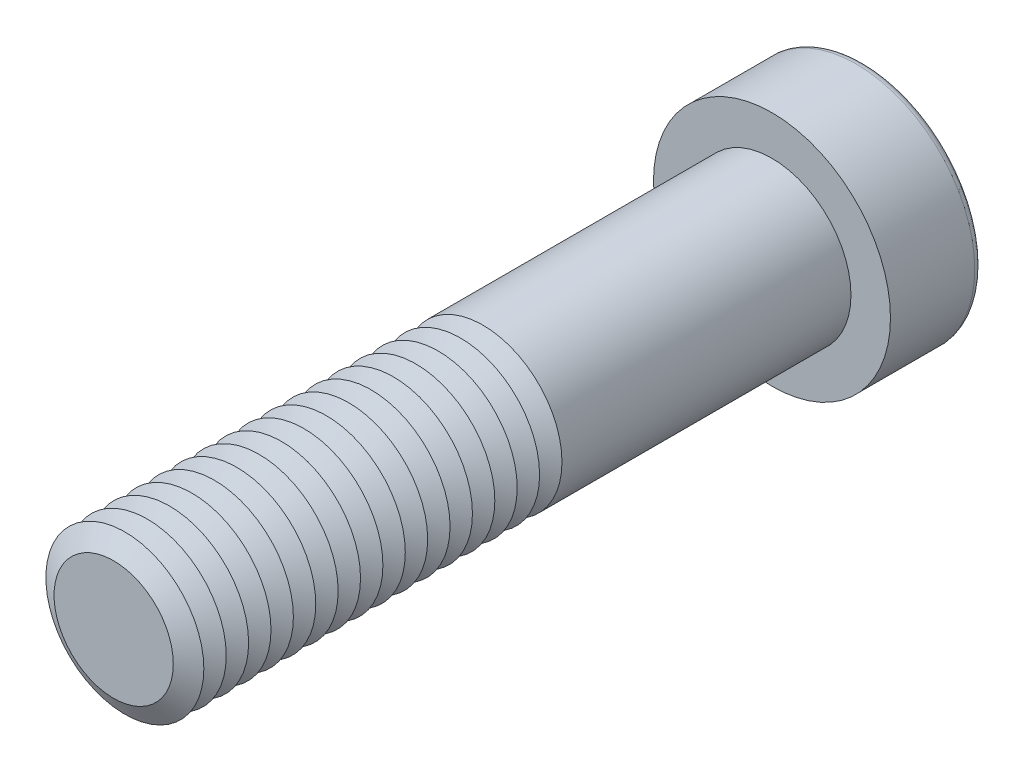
ISO-10303-21;
HEADER;
FILE_DESCRIPTION(('STEP AP214'),'2;1');
FILE_NAME('part.step','',(''),(''),'','','');
FILE_SCHEMA(('AUTOMOTIVE_DESIGN { 1 0 10303 214 1 1 1 1 }'));
ENDSEC;
DATA;
#1=APPLICATION_CONTEXT('core data for automotive mechanical design processes');
#2=APPLICATION_PROTOCOL_DEFINITION('international standard','automotive_design',2000,#1);
#3=PRODUCT_CONTEXT('',#1,'mechanical');
#4=PRODUCT('Part','Part','',(#3));
#5=PRODUCT_RELATED_PRODUCT_CATEGORY('part','',(#4));
#6=PRODUCT_DEFINITION_FORMATION('','',#4);
#7=PRODUCT_DEFINITION_CONTEXT('part definition',#1,'design');
#8=PRODUCT_DEFINITION('design','',#6,#7);
#9=PRODUCT_DEFINITION_SHAPE('','',#8);
#10=(LENGTH_UNIT() NAMED_UNIT(*) SI_UNIT(.MILLI.,.METRE.));
#11=(NAMED_UNIT(*) PLANE_ANGLE_UNIT() SI_UNIT($,.RADIAN.));
#12=(NAMED_UNIT(*) SI_UNIT($,.STERADIAN.) SOLID_ANGLE_UNIT());
#13=UNCERTAINTY_MEASURE_WITH_UNIT(LENGTH_MEASURE(1.E-05),#10,'distance_accuracy_value','');
#14=(GEOMETRIC_REPRESENTATION_CONTEXT(3) GLOBAL_UNCERTAINTY_ASSIGNED_CONTEXT((#13)) GLOBAL_UNIT_ASSIGNED_CONTEXT((#10,
#11,#12)) REPRESENTATION_CONTEXT('',''));
#15=CARTESIAN_POINT('',(0.,0.,0.));
#16=DIRECTION('',(0.,0.,1.));
#17=DIRECTION('',(1.,0.,0.));
#18=AXIS2_PLACEMENT_3D('',#15,#16,#17);
#19=CARTESIAN_POINT('',(0.,0.,44.05));
#20=DIRECTION('',(0.,0.,1.));
#21=DIRECTION('',(1.,0.,0.));
#22=AXIS2_PLACEMENT_3D('',#19,#20,#21);
#23=CONICAL_SURFACE('',#22,6.,1.0471975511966);
#24=CARTESIAN_POINT('',(0.,0.,43.2));
#25=DIRECTION('',(0.,0.,1.));
#26=DIRECTION('',(1.,0.,0.));
#27=AXIS2_PLACEMENT_3D('',#24,#25,#26);
#28=CIRCLE('',#27,4.52775681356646);
#29=CARTESIAN_POINT('',(4.52775681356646,0.,43.2));
#30=VERTEX_POINT('',#29);
#31=EDGE_CURVE('E310',#30,#30,#28,.T.);
#32=ORIENTED_EDGE('',*,*,#31,.T.);
#33=EDGE_LOOP('',(#32));
#34=FACE_BOUND('',#33,.T.);
#35=CARTESIAN_POINT('',(0.,0.,44.05));
#36=DIRECTION('',(0.,0.,1.));
#37=DIRECTION('',(1.,0.,0.));
#38=AXIS2_PLACEMENT_3D('',#35,#36,#37);
#39=CIRCLE('',#38,6.);
#40=CARTESIAN_POINT('',(6.,0.,44.05));
#41=VERTEX_POINT('',#40);
#42=EDGE_CURVE('E313',#41,#41,#39,.T.);
#43=ORIENTED_EDGE('',*,*,#42,.F.);
#44=EDGE_LOOP('',(#43));
#45=FACE_BOUND('',#44,.T.);
#46=ADVANCED_FACE('F39',(#34,#45),#23,.T.);
#47=CARTESIAN_POINT('',(0.,0.,43.2));
#48=DIRECTION('',(0.,0.,-1.));
#49=DIRECTION('',(-1.,0.,0.));
#50=AXIS2_PLACEMENT_3D('',#47,#48,#49);
#51=CONICAL_SURFACE('',#50,4.52775681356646,1.0471975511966);
#52=CARTESIAN_POINT('',(0.,0.,42.35));
#53=DIRECTION('',(0.,0.,1.));
#54=DIRECTION('',(1.,0.,0.));
#55=AXIS2_PLACEMENT_3D('',#52,#53,#54);
#56=CIRCLE('',#55,6.);
#57=CARTESIAN_POINT('',(6.,0.,42.35));
#58=VERTEX_POINT('',#57);
#59=EDGE_CURVE('E321',#58,#58,#56,.T.);
#60=ORIENTED_EDGE('',*,*,#59,.T.);
#61=EDGE_LOOP('',(#60));
#62=FACE_BOUND('',#61,.T.);
#63=ORIENTED_EDGE('',*,*,#31,.F.);
#64=EDGE_LOOP('',(#63));
#65=FACE_BOUND('',#64,.T.);
#66=ADVANCED_FACE('F244',(#62,#65),#51,.T.);
#67=CARTESIAN_POINT('',(0.,0.,50.));
#68=DIRECTION('',(0.,0.,1.));
#69=DIRECTION('',(1.,0.,0.));
#70=AXIS2_PLACEMENT_3D('',#67,#68,#69);
#71=PLANE('',#70);
#72=CARTESIAN_POINT('',(0.,0.,50.));
#73=DIRECTION('',(0.,0.,1.));
#74=DIRECTION('',(1.,0.,0.));
#75=AXIS2_PLACEMENT_3D('',#72,#73,#74);
#76=CIRCLE('',#75,4.52775681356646);
#77=CARTESIAN_POINT('',(4.52775681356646,0.,50.));
#78=VERTEX_POINT('',#77);
#79=EDGE_CURVE('E173',#78,#78,#76,.T.);
#80=ORIENTED_EDGE('',*,*,#79,.T.);
#81=EDGE_LOOP('',(#80));
#82=FACE_BOUND('',#81,.T.);
#83=ADVANCED_FACE('F250',(#82),#71,.T.);
#84=CARTESIAN_POINT('',(0.,0.,50.));
#85=DIRECTION('',(0.,0.,-1.));
#86=DIRECTION('',(-1.,0.,0.));
#87=AXIS2_PLACEMENT_3D('',#84,#85,#86);
#88=CONICAL_SURFACE('',#87,4.52775681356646,1.0471975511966);
#89=CARTESIAN_POINT('',(0.,0.,49.15));
#90=DIRECTION('',(0.,0.,1.));
#91=DIRECTION('',(1.,0.,0.));
#92=AXIS2_PLACEMENT_3D('',#89,#90,#91);
#93=CIRCLE('',#92,6.);
#94=CARTESIAN_POINT('',(6.,0.,49.15));
#95=VERTEX_POINT('',#94);
#96=EDGE_CURVE('E290',#95,#95,#93,.T.);
#97=ORIENTED_EDGE('',*,*,#96,.T.);
#98=EDGE_LOOP('',(#97));
#99=FACE_BOUND('',#98,.T.);
#100=ORIENTED_EDGE('',*,*,#79,.F.);
#101=EDGE_LOOP('',(#100));
#102=FACE_BOUND('',#101,.T.);
#103=ADVANCED_FACE('F198',(#99,#102),#88,.T.);
#104=CARTESIAN_POINT('',(0.,0.,49.15));
#105=DIRECTION('',(0.,0.,1.));
#106=DIRECTION('',(1.,0.,0.));
#107=AXIS2_PLACEMENT_3D('',#104,#105,#106);
#108=CONICAL_SURFACE('',#107,6.,1.0471975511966);
#109=CARTESIAN_POINT('',(0.,0.,48.3));
#110=DIRECTION('',(0.,0.,1.));
#111=DIRECTION('',(1.,0.,0.));
#112=AXIS2_PLACEMENT_3D('',#109,#110,#111);
#113=CIRCLE('',#112,4.52775681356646);
#114=CARTESIAN_POINT('',(4.52775681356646,0.,48.3));
#115=VERTEX_POINT('',#114);
#116=EDGE_CURVE('E287',#115,#115,#113,.T.);
#117=ORIENTED_EDGE('',*,*,#116,.T.);
#118=EDGE_LOOP('',(#117));
#119=FACE_BOUND('',#118,.T.);
#120=ORIENTED_EDGE('',*,*,#96,.F.);
#121=EDGE_LOOP('',(#120));
#122=FACE_BOUND('',#121,.T.);
#123=ADVANCED_FACE('F276',(#119,#122),#108,.T.);
#124=CARTESIAN_POINT('',(0.,0.,48.3));
#125=DIRECTION('',(0.,0.,-1.));
#126=DIRECTION('',(-1.,0.,0.));
#127=AXIS2_PLACEMENT_3D('',#124,#125,#126);
#128=CONICAL_SURFACE('',#127,4.52775681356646,1.0471975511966);
#129=CARTESIAN_POINT('',(0.,0.,47.45));
#130=DIRECTION('',(0.,0.,1.));
#131=DIRECTION('',(1.,0.,0.));
#132=AXIS2_PLACEMENT_3D('',#129,#130,#131);
#133=CIRCLE('',#132,6.);
#134=CARTESIAN_POINT('',(6.,0.,47.45));
#135=VERTEX_POINT('',#134);
#136=EDGE_CURVE('E297',#135,#135,#133,.T.);
#137=ORIENTED_EDGE('',*,*,#136,.T.);
#138=EDGE_LOOP('',(#137));
#139=FACE_BOUND('',#138,.T.);
#140=ORIENTED_EDGE('',*,*,#116,.F.);
#141=EDGE_LOOP('',(#140));
#142=FACE_BOUND('',#141,.T.);
#143=ADVANCED_FACE('F273',(#139,#142),#128,.T.);
#144=CARTESIAN_POINT('',(0.,0.,47.45));
#145=DIRECTION('',(0.,0.,1.));
#146=DIRECTION('',(1.,0.,0.));
#147=AXIS2_PLACEMENT_3D('',#144,#145,#146);
#148=CONICAL_SURFACE('',#147,6.,1.0471975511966);
#149=CARTESIAN_POINT('',(0.,0.,46.6));
#150=DIRECTION('',(0.,0.,1.));
#151=DIRECTION('',(1.,0.,0.));
#152=AXIS2_PLACEMENT_3D('',#149,#150,#151);
#153=CIRCLE('',#152,4.52775681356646);
#154=CARTESIAN_POINT('',(4.52775681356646,0.,46.6));
#155=VERTEX_POINT('',#154);
#156=EDGE_CURVE('E292',#155,#155,#153,.T.);
#157=ORIENTED_EDGE('',*,*,#156,.T.);
#158=EDGE_LOOP('',(#157));
#159=FACE_BOUND('',#158,.T.);
#160=ORIENTED_EDGE('',*,*,#136,.F.);
#161=EDGE_LOOP('',(#160));
#162=FACE_BOUND('',#161,.T.);
#163=ADVANCED_FACE('F269',(#159,#162),#148,.T.);
#164=CARTESIAN_POINT('',(0.,0.,46.6));
#165=DIRECTION('',(0.,0.,-1.));
#166=DIRECTION('',(-1.,0.,0.));
#167=AXIS2_PLACEMENT_3D('',#164,#165,#166);
#168=CONICAL_SURFACE('',#167,4.52775681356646,1.0471975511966);
#169=CARTESIAN_POINT('',(0.,0.,45.75));
#170=DIRECTION('',(0.,0.,1.));
#171=DIRECTION('',(1.,0.,0.));
#172=AXIS2_PLACEMENT_3D('',#169,#170,#171);
#173=CIRCLE('',#172,6.);
#174=CARTESIAN_POINT('',(6.,0.,45.75));
#175=VERTEX_POINT('',#174);
#176=EDGE_CURVE('E306',#175,#175,#173,.T.);
#177=ORIENTED_EDGE('',*,*,#176,.T.);
#178=EDGE_LOOP('',(#177));
#179=FACE_BOUND('',#178,.T.);
#180=ORIENTED_EDGE('',*,*,#156,.F.);
#181=EDGE_LOOP('',(#180));
#182=FACE_BOUND('',#181,.T.);
#183=ADVANCED_FACE('F265',(#179,#182),#168,.T.);
#184=CARTESIAN_POINT('',(0.,0.,45.75));
#185=DIRECTION('',(0.,0.,1.));
#186=DIRECTION('',(1.,0.,0.));
#187=AXIS2_PLACEMENT_3D('',#184,#185,#186);
#188=CONICAL_SURFACE('',#187,6.,1.0471975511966);
#189=CARTESIAN_POINT('',(0.,0.,44.9));
#190=DIRECTION('',(0.,0.,1.));
#191=DIRECTION('',(1.,0.,0.));
#192=AXIS2_PLACEMENT_3D('',#189,#190,#191);
#193=CIRCLE('',#192,4.52775681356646);
#194=CARTESIAN_POINT('',(4.52775681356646,0.,44.9));
#195=VERTEX_POINT('',#194);
#196=EDGE_CURVE('E302',#195,#195,#193,.T.);
#197=ORIENTED_EDGE('',*,*,#196,.T.);
#198=EDGE_LOOP('',(#197));
#199=FACE_BOUND('',#198,.T.);
#200=ORIENTED_EDGE('',*,*,#176,.F.);
#201=EDGE_LOOP('',(#200));
#202=FACE_BOUND('',#201,.T.);
#203=ADVANCED_FACE('F261',(#199,#202),#188,.T.);
#204=CARTESIAN_POINT('',(0.,0.,44.9));
#205=DIRECTION('',(0.,0.,-1.));
#206=DIRECTION('',(-1.,0.,0.));
#207=AXIS2_PLACEMENT_3D('',#204,#205,#206);
#208=CONICAL_SURFACE('',#207,4.52775681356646,1.0471975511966);
#209=ORIENTED_EDGE('',*,*,#42,.T.);
#210=EDGE_LOOP('',(#209));
#211=FACE_BOUND('',#210,.T.);
#212=ORIENTED_EDGE('',*,*,#196,.F.);
#213=EDGE_LOOP('',(#212));
#214=FACE_BOUND('',#213,.T.);
#215=ADVANCED_FACE('F257',(#211,#214),#208,.T.);
#216=CARTESIAN_POINT('',(0.,0.,42.35));
#217=DIRECTION('',(0.,0.,1.));
#218=DIRECTION('',(1.,0.,0.));
#219=AXIS2_PLACEMENT_3D('',#216,#217,#218);
#220=CONICAL_SURFACE('',#219,6.,1.0471975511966);
#221=CARTESIAN_POINT('',(0.,0.,41.5));
#222=DIRECTION('',(0.,0.,1.));
#223=DIRECTION('',(1.,0.,0.));
#224=AXIS2_PLACEMENT_3D('',#221,#222,#223);
#225=CIRCLE('',#224,4.52775681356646);
#226=CARTESIAN_POINT('',(4.52775681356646,0.,41.5));
#227=VERTEX_POINT('',#226);
#228=EDGE_CURVE('E317',#227,#227,#225,.T.);
#229=ORIENTED_EDGE('',*,*,#228,.T.);
#230=EDGE_LOOP('',(#229));
#231=FACE_BOUND('',#230,.T.);
#232=ORIENTED_EDGE('',*,*,#59,.F.);
#233=EDGE_LOOP('',(#232));
#234=FACE_BOUND('',#233,.T.);
#235=ADVANCED_FACE('F260',(#231,#234),#220,.T.);
#236=CARTESIAN_POINT('',(0.,0.,41.5));
#237=DIRECTION('',(0.,0.,-1.));
#238=DIRECTION('',(-1.,0.,0.));
#239=AXIS2_PLACEMENT_3D('',#236,#237,#238);
#240=CONICAL_SURFACE('',#239,4.52775681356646,1.0471975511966);
#241=CARTESIAN_POINT('',(0.,0.,40.65));
#242=DIRECTION('',(0.,0.,1.));
#243=DIRECTION('',(1.,0.,0.));
#244=AXIS2_PLACEMENT_3D('',#241,#242,#243);
#245=CIRCLE('',#244,6.);
#246=CARTESIAN_POINT('',(6.,0.,40.65));
#247=VERTEX_POINT('',#246);
#248=EDGE_CURVE('E329',#247,#247,#245,.T.);
#249=ORIENTED_EDGE('',*,*,#248,.T.);
#250=EDGE_LOOP('',(#249));
#251=FACE_BOUND('',#250,.T.);
#252=ORIENTED_EDGE('',*,*,#228,.F.);
#253=EDGE_LOOP('',(#252));
#254=FACE_BOUND('',#253,.T.);
#255=ADVANCED_FACE('F510',(#251,#254),#240,.T.);
#256=CARTESIAN_POINT('',(0.,0.,40.65));
#257=DIRECTION('',(0.,0.,1.));
#258=DIRECTION('',(1.,0.,0.));
#259=AXIS2_PLACEMENT_3D('',#256,#257,#258);
#260=CONICAL_SURFACE('',#259,6.,1.0471975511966);
#261=CARTESIAN_POINT('',(0.,0.,39.8));
#262=DIRECTION('',(0.,0.,1.));
#263=DIRECTION('',(1.,0.,0.));
#264=AXIS2_PLACEMENT_3D('',#261,#262,#263);
#265=CIRCLE('',#264,4.52775681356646);
#266=CARTESIAN_POINT('',(4.52775681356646,0.,39.8));
#267=VERTEX_POINT('',#266);
#268=EDGE_CURVE('E325',#267,#267,#265,.T.);
#269=ORIENTED_EDGE('',*,*,#268,.T.);
#270=EDGE_LOOP('',(#269));
#271=FACE_BOUND('',#270,.T.);
#272=ORIENTED_EDGE('',*,*,#248,.F.);
#273=EDGE_LOOP('',(#272));
#274=FACE_BOUND('',#273,.T.);
#275=ADVANCED_FACE('F506',(#271,#274),#260,.T.);
#276=CARTESIAN_POINT('',(0.,0.,39.8));
#277=DIRECTION('',(0.,0.,-1.));
#278=DIRECTION('',(-1.,0.,0.));
#279=AXIS2_PLACEMENT_3D('',#276,#277,#278);
#280=CONICAL_SURFACE('',#279,4.52775681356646,1.0471975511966);
#281=CARTESIAN_POINT('',(0.,0.,38.95));
#282=DIRECTION('',(0.,0.,1.));
#283=DIRECTION('',(1.,0.,0.));
#284=AXIS2_PLACEMENT_3D('',#281,#282,#283);
#285=CIRCLE('',#284,6.);
#286=CARTESIAN_POINT('',(6.,0.,38.95));
#287=VERTEX_POINT('',#286);
#288=EDGE_CURVE('E337',#287,#287,#285,.T.);
#289=ORIENTED_EDGE('',*,*,#288,.T.);
#290=EDGE_LOOP('',(#289));
#291=FACE_BOUND('',#290,.T.);
#292=ORIENTED_EDGE('',*,*,#268,.F.);
#293=EDGE_LOOP('',(#292));
#294=FACE_BOUND('',#293,.T.);
#295=ADVANCED_FACE('F502',(#291,#294),#280,.T.);
#296=CARTESIAN_POINT('',(0.,0.,38.95));
#297=DIRECTION('',(0.,0.,1.));
#298=DIRECTION('',(1.,0.,0.));
#299=AXIS2_PLACEMENT_3D('',#296,#297,#298);
#300=CONICAL_SURFACE('',#299,6.,1.0471975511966);
#301=CARTESIAN_POINT('',(0.,0.,38.1));
#302=DIRECTION('',(0.,0.,1.));
#303=DIRECTION('',(1.,0.,0.));
#304=AXIS2_PLACEMENT_3D('',#301,#302,#303);
#305=CIRCLE('',#304,4.52775681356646);
#306=CARTESIAN_POINT('',(4.52775681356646,0.,38.1));
#307=VERTEX_POINT('',#306);
#308=EDGE_CURVE('E333',#307,#307,#305,.T.);
#309=ORIENTED_EDGE('',*,*,#308,.T.);
#310=EDGE_LOOP('',(#309));
#311=FACE_BOUND('',#310,.T.);
#312=ORIENTED_EDGE('',*,*,#288,.F.);
#313=EDGE_LOOP('',(#312));
#314=FACE_BOUND('',#313,.T.);
#315=ADVANCED_FACE('F498',(#311,#314),#300,.T.);
#316=CARTESIAN_POINT('',(0.,0.,38.1));
#317=DIRECTION('',(0.,0.,-1.));
#318=DIRECTION('',(-1.,0.,0.));
#319=AXIS2_PLACEMENT_3D('',#316,#317,#318);
#320=CONICAL_SURFACE('',#319,4.52775681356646,1.0471975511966);
#321=CARTESIAN_POINT('',(0.,0.,37.25));
#322=DIRECTION('',(0.,0.,1.));
#323=DIRECTION('',(1.,0.,0.));
#324=AXIS2_PLACEMENT_3D('',#321,#322,#323);
#325=CIRCLE('',#324,6.);
#326=CARTESIAN_POINT('',(6.,0.,37.25));
#327=VERTEX_POINT('',#326);
#328=EDGE_CURVE('E345',#327,#327,#325,.T.);
#329=ORIENTED_EDGE('',*,*,#328,.T.);
#330=EDGE_LOOP('',(#329));
#331=FACE_BOUND('',#330,.T.);
#332=ORIENTED_EDGE('',*,*,#308,.F.);
#333=EDGE_LOOP('',(#332));
#334=FACE_BOUND('',#333,.T.);
#335=ADVANCED_FACE('F494',(#331,#334),#320,.T.);
#336=CARTESIAN_POINT('',(0.,0.,37.25));
#337=DIRECTION('',(0.,0.,1.));
#338=DIRECTION('',(1.,0.,0.));
#339=AXIS2_PLACEMENT_3D('',#336,#337,#338);
#340=CONICAL_SURFACE('',#339,6.,1.0471975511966);
#341=CARTESIAN_POINT('',(0.,0.,36.4));
#342=DIRECTION('',(0.,0.,1.));
#343=DIRECTION('',(1.,0.,0.));
#344=AXIS2_PLACEMENT_3D('',#341,#342,#343);
#345=CIRCLE('',#344,4.52775681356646);
#346=CARTESIAN_POINT('',(4.52775681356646,0.,36.4));
#347=VERTEX_POINT('',#346);
#348=EDGE_CURVE('E341',#347,#347,#345,.T.);
#349=ORIENTED_EDGE('',*,*,#348,.T.);
#350=EDGE_LOOP('',(#349));
#351=FACE_BOUND('',#350,.T.);
#352=ORIENTED_EDGE('',*,*,#328,.F.);
#353=EDGE_LOOP('',(#352));
#354=FACE_BOUND('',#353,.T.);
#355=ADVANCED_FACE('F490',(#351,#354),#340,.T.);
#356=CARTESIAN_POINT('',(0.,0.,36.4));
#357=DIRECTION('',(0.,0.,-1.));
#358=DIRECTION('',(-1.,0.,0.));
#359=AXIS2_PLACEMENT_3D('',#356,#357,#358);
#360=CONICAL_SURFACE('',#359,4.52775681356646,1.0471975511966);
#361=CARTESIAN_POINT('',(0.,0.,35.55));
#362=DIRECTION('',(0.,0.,1.));
#363=DIRECTION('',(1.,0.,0.));
#364=AXIS2_PLACEMENT_3D('',#361,#362,#363);
#365=CIRCLE('',#364,6.);
#366=CARTESIAN_POINT('',(6.,0.,35.55));
#367=VERTEX_POINT('',#366);
#368=EDGE_CURVE('E353',#367,#367,#365,.T.);
#369=ORIENTED_EDGE('',*,*,#368,.T.);
#370=EDGE_LOOP('',(#369));
#371=FACE_BOUND('',#370,.T.);
#372=ORIENTED_EDGE('',*,*,#348,.F.);
#373=EDGE_LOOP('',(#372));
#374=FACE_BOUND('',#373,.T.);
#375=ADVANCED_FACE('F486',(#371,#374),#360,.T.);
#376=CARTESIAN_POINT('',(0.,0.,35.55));
#377=DIRECTION('',(0.,0.,1.));
#378=DIRECTION('',(1.,0.,0.));
#379=AXIS2_PLACEMENT_3D('',#376,#377,#378);
#380=CONICAL_SURFACE('',#379,6.,1.0471975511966);
#381=CARTESIAN_POINT('',(0.,0.,34.7));
#382=DIRECTION('',(0.,0.,1.));
#383=DIRECTION('',(1.,0.,0.));
#384=AXIS2_PLACEMENT_3D('',#381,#382,#383);
#385=CIRCLE('',#384,4.52775681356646);
#386=CARTESIAN_POINT('',(4.52775681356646,0.,34.7));
#387=VERTEX_POINT('',#386);
#388=EDGE_CURVE('E349',#387,#387,#385,.T.);
#389=ORIENTED_EDGE('',*,*,#388,.T.);
#390=EDGE_LOOP('',(#389));
#391=FACE_BOUND('',#390,.T.);
#392=ORIENTED_EDGE('',*,*,#368,.F.);
#393=EDGE_LOOP('',(#392));
#394=FACE_BOUND('',#393,.T.);
#395=ADVANCED_FACE('F482',(#391,#394),#380,.T.);
#396=CARTESIAN_POINT('',(0.,0.,34.7));
#397=DIRECTION('',(0.,0.,-1.));
#398=DIRECTION('',(-1.,0.,0.));
#399=AXIS2_PLACEMENT_3D('',#396,#397,#398);
#400=CONICAL_SURFACE('',#399,4.52775681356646,1.0471975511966);
#401=CARTESIAN_POINT('',(0.,0.,33.85));
#402=DIRECTION('',(0.,0.,1.));
#403=DIRECTION('',(1.,0.,0.));
#404=AXIS2_PLACEMENT_3D('',#401,#402,#403);
#405=CIRCLE('',#404,6.);
#406=CARTESIAN_POINT('',(6.,0.,33.85));
#407=VERTEX_POINT('',#406);
#408=EDGE_CURVE('E361',#407,#407,#405,.T.);
#409=ORIENTED_EDGE('',*,*,#408,.T.);
#410=EDGE_LOOP('',(#409));
#411=FACE_BOUND('',#410,.T.);
#412=ORIENTED_EDGE('',*,*,#388,.F.);
#413=EDGE_LOOP('',(#412));
#414=FACE_BOUND('',#413,.T.);
#415=ADVANCED_FACE('F478',(#411,#414),#400,.T.);
#416=CARTESIAN_POINT('',(0.,0.,33.85));
#417=DIRECTION('',(0.,0.,1.));
#418=DIRECTION('',(1.,0.,0.));
#419=AXIS2_PLACEMENT_3D('',#416,#417,#418);
#420=CONICAL_SURFACE('',#419,6.,1.0471975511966);
#421=CARTESIAN_POINT('',(0.,0.,33.));
#422=DIRECTION('',(0.,0.,1.));
#423=DIRECTION('',(1.,0.,0.));
#424=AXIS2_PLACEMENT_3D('',#421,#422,#423);
#425=CIRCLE('',#424,4.52775681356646);
#426=CARTESIAN_POINT('',(4.52775681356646,0.,33.));
#427=VERTEX_POINT('',#426);
#428=EDGE_CURVE('E357',#427,#427,#425,.T.);
#429=ORIENTED_EDGE('',*,*,#428,.T.);
#430=EDGE_LOOP('',(#429));
#431=FACE_BOUND('',#430,.T.);
#432=ORIENTED_EDGE('',*,*,#408,.F.);
#433=EDGE_LOOP('',(#432));
#434=FACE_BOUND('',#433,.T.);
#435=ADVANCED_FACE('F474',(#431,#434),#420,.T.);
#436=CARTESIAN_POINT('',(0.,0.,33.));
#437=DIRECTION('',(0.,0.,-1.));
#438=DIRECTION('',(-1.,0.,0.));
#439=AXIS2_PLACEMENT_3D('',#436,#437,#438);
#440=CONICAL_SURFACE('',#439,4.52775681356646,1.0471975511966);
#441=CARTESIAN_POINT('',(0.,0.,32.15));
#442=DIRECTION('',(0.,0.,1.));
#443=DIRECTION('',(1.,0.,0.));
#444=AXIS2_PLACEMENT_3D('',#441,#442,#443);
#445=CIRCLE('',#444,6.);
#446=CARTESIAN_POINT('',(6.,0.,32.15));
#447=VERTEX_POINT('',#446);
#448=EDGE_CURVE('E369',#447,#447,#445,.T.);
#449=ORIENTED_EDGE('',*,*,#448,.T.);
#450=EDGE_LOOP('',(#449));
#451=FACE_BOUND('',#450,.T.);
#452=ORIENTED_EDGE('',*,*,#428,.F.);
#453=EDGE_LOOP('',(#452));
#454=FACE_BOUND('',#453,.T.);
#455=ADVANCED_FACE('F470',(#451,#454),#440,.T.);
#456=CARTESIAN_POINT('',(0.,0.,32.15));
#457=DIRECTION('',(0.,0.,1.));
#458=DIRECTION('',(1.,0.,0.));
#459=AXIS2_PLACEMENT_3D('',#456,#457,#458);
#460=CONICAL_SURFACE('',#459,6.,1.0471975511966);
#461=CARTESIAN_POINT('',(0.,0.,31.3));
#462=DIRECTION('',(0.,0.,1.));
#463=DIRECTION('',(1.,0.,0.));
#464=AXIS2_PLACEMENT_3D('',#461,#462,#463);
#465=CIRCLE('',#464,4.52775681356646);
#466=CARTESIAN_POINT('',(4.52775681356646,0.,31.3));
#467=VERTEX_POINT('',#466);
#468=EDGE_CURVE('E365',#467,#467,#465,.T.);
#469=ORIENTED_EDGE('',*,*,#468,.T.);
#470=EDGE_LOOP('',(#469));
#471=FACE_BOUND('',#470,.T.);
#472=ORIENTED_EDGE('',*,*,#448,.F.);
#473=EDGE_LOOP('',(#472));
#474=FACE_BOUND('',#473,.T.);
#475=ADVANCED_FACE('F466',(#471,#474),#460,.T.);
#476=CARTESIAN_POINT('',(0.,0.,31.3));
#477=DIRECTION('',(0.,0.,-1.));
#478=DIRECTION('',(-1.,0.,0.));
#479=AXIS2_PLACEMENT_3D('',#476,#477,#478);
#480=CONICAL_SURFACE('',#479,4.52775681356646,1.0471975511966);
#481=CARTESIAN_POINT('',(0.,0.,30.45));
#482=DIRECTION('',(0.,0.,1.));
#483=DIRECTION('',(1.,0.,0.));
#484=AXIS2_PLACEMENT_3D('',#481,#482,#483);
#485=CIRCLE('',#484,6.);
#486=CARTESIAN_POINT('',(6.,0.,30.45));
#487=VERTEX_POINT('',#486);
#488=EDGE_CURVE('E377',#487,#487,#485,.T.);
#489=ORIENTED_EDGE('',*,*,#488,.T.);
#490=EDGE_LOOP('',(#489));
#491=FACE_BOUND('',#490,.T.);
#492=ORIENTED_EDGE('',*,*,#468,.F.);
#493=EDGE_LOOP('',(#492));
#494=FACE_BOUND('',#493,.T.);
#495=ADVANCED_FACE('F462',(#491,#494),#480,.T.);
#496=CARTESIAN_POINT('',(0.,0.,30.45));
#497=DIRECTION('',(0.,0.,1.));
#498=DIRECTION('',(1.,0.,0.));
#499=AXIS2_PLACEMENT_3D('',#496,#497,#498);
#500=CONICAL_SURFACE('',#499,6.,1.0471975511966);
#501=CARTESIAN_POINT('',(0.,0.,29.6));
#502=DIRECTION('',(0.,0.,1.));
#503=DIRECTION('',(1.,0.,0.));
#504=AXIS2_PLACEMENT_3D('',#501,#502,#503);
#505=CIRCLE('',#504,4.52775681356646);
#506=CARTESIAN_POINT('',(4.52775681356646,0.,29.6));
#507=VERTEX_POINT('',#506);
#508=EDGE_CURVE('E373',#507,#507,#505,.T.);
#509=ORIENTED_EDGE('',*,*,#508,.T.);
#510=EDGE_LOOP('',(#509));
#511=FACE_BOUND('',#510,.T.);
#512=ORIENTED_EDGE('',*,*,#488,.F.);
#513=EDGE_LOOP('',(#512));
#514=FACE_BOUND('',#513,.T.);
#515=ADVANCED_FACE('F458',(#511,#514),#500,.T.);
#516=CARTESIAN_POINT('',(0.,0.,29.6));
#517=DIRECTION('',(0.,0.,-1.));
#518=DIRECTION('',(-1.,0.,0.));
#519=AXIS2_PLACEMENT_3D('',#516,#517,#518);
#520=CONICAL_SURFACE('',#519,4.52775681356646,1.0471975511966);
#521=CARTESIAN_POINT('',(0.,0.,28.75));
#522=DIRECTION('',(0.,0.,1.));
#523=DIRECTION('',(1.,0.,0.));
#524=AXIS2_PLACEMENT_3D('',#521,#522,#523);
#525=CIRCLE('',#524,6.);
#526=CARTESIAN_POINT('',(6.,0.,28.75));
#527=VERTEX_POINT('',#526);
#528=EDGE_CURVE('E385',#527,#527,#525,.T.);
#529=ORIENTED_EDGE('',*,*,#528,.T.);
#530=EDGE_LOOP('',(#529));
#531=FACE_BOUND('',#530,.T.);
#532=ORIENTED_EDGE('',*,*,#508,.F.);
#533=EDGE_LOOP('',(#532));
#534=FACE_BOUND('',#533,.T.);
#535=ADVANCED_FACE('F454',(#531,#534),#520,.T.);
#536=CARTESIAN_POINT('',(0.,0.,28.75));
#537=DIRECTION('',(0.,0.,1.));
#538=DIRECTION('',(1.,0.,0.));
#539=AXIS2_PLACEMENT_3D('',#536,#537,#538);
#540=CONICAL_SURFACE('',#539,6.,1.0471975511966);
#541=CARTESIAN_POINT('',(0.,0.,27.9));
#542=DIRECTION('',(0.,0.,1.));
#543=DIRECTION('',(1.,0.,0.));
#544=AXIS2_PLACEMENT_3D('',#541,#542,#543);
#545=CIRCLE('',#544,4.52775681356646);
#546=CARTESIAN_POINT('',(4.52775681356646,0.,27.9));
#547=VERTEX_POINT('',#546);
#548=EDGE_CURVE('E381',#547,#547,#545,.T.);
#549=ORIENTED_EDGE('',*,*,#548,.T.);
#550=EDGE_LOOP('',(#549));
#551=FACE_BOUND('',#550,.T.);
#552=ORIENTED_EDGE('',*,*,#528,.F.);
#553=EDGE_LOOP('',(#552));
#554=FACE_BOUND('',#553,.T.);
#555=ADVANCED_FACE('F450',(#551,#554),#540,.T.);
#556=CARTESIAN_POINT('',(0.,0.,27.9));
#557=DIRECTION('',(0.,0.,-1.));
#558=DIRECTION('',(-1.,0.,0.));
#559=AXIS2_PLACEMENT_3D('',#556,#557,#558);
#560=CONICAL_SURFACE('',#559,4.52775681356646,1.0471975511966);
#561=CARTESIAN_POINT('',(0.,0.,27.05));
#562=DIRECTION('',(0.,0.,1.));
#563=DIRECTION('',(1.,0.,0.));
#564=AXIS2_PLACEMENT_3D('',#561,#562,#563);
#565=CIRCLE('',#564,6.);
#566=CARTESIAN_POINT('',(6.,0.,27.05));
#567=VERTEX_POINT('',#566);
#568=EDGE_CURVE('E393',#567,#567,#565,.T.);
#569=ORIENTED_EDGE('',*,*,#568,.T.);
#570=EDGE_LOOP('',(#569));
#571=FACE_BOUND('',#570,.T.);
#572=ORIENTED_EDGE('',*,*,#548,.F.);
#573=EDGE_LOOP('',(#572));
#574=FACE_BOUND('',#573,.T.);
#575=ADVANCED_FACE('F446',(#571,#574),#560,.T.);
#576=CARTESIAN_POINT('',(0.,0.,27.05));
#577=DIRECTION('',(0.,0.,1.));
#578=DIRECTION('',(1.,0.,0.));
#579=AXIS2_PLACEMENT_3D('',#576,#577,#578);
#580=CONICAL_SURFACE('',#579,6.,1.0471975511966);
#581=CARTESIAN_POINT('',(0.,0.,26.2));
#582=DIRECTION('',(0.,0.,1.));
#583=DIRECTION('',(1.,0.,0.));
#584=AXIS2_PLACEMENT_3D('',#581,#582,#583);
#585=CIRCLE('',#584,4.52775681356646);
#586=CARTESIAN_POINT('',(4.52775681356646,0.,26.2));
#587=VERTEX_POINT('',#586);
#588=EDGE_CURVE('E389',#587,#587,#585,.T.);
#589=ORIENTED_EDGE('',*,*,#588,.T.);
#590=EDGE_LOOP('',(#589));
#591=FACE_BOUND('',#590,.T.);
#592=ORIENTED_EDGE('',*,*,#568,.F.);
#593=EDGE_LOOP('',(#592));
#594=FACE_BOUND('',#593,.T.);
#595=ADVANCED_FACE('F442',(#591,#594),#580,.T.);
#596=CARTESIAN_POINT('',(0.,0.,26.2));
#597=DIRECTION('',(0.,0.,-1.));
#598=DIRECTION('',(-1.,0.,0.));
#599=AXIS2_PLACEMENT_3D('',#596,#597,#598);
#600=CONICAL_SURFACE('',#599,4.52775681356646,1.0471975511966);
#601=CARTESIAN_POINT('',(0.,0.,25.35));
#602=DIRECTION('',(0.,0.,1.));
#603=DIRECTION('',(1.,0.,0.));
#604=AXIS2_PLACEMENT_3D('',#601,#602,#603);
#605=CIRCLE('',#604,6.);
#606=CARTESIAN_POINT('',(6.,0.,25.35));
#607=VERTEX_POINT('',#606);
#608=EDGE_CURVE('E401',#607,#607,#605,.T.);
#609=ORIENTED_EDGE('',*,*,#608,.T.);
#610=EDGE_LOOP('',(#609));
#611=FACE_BOUND('',#610,.T.);
#612=ORIENTED_EDGE('',*,*,#588,.F.);
#613=EDGE_LOOP('',(#612));
#614=FACE_BOUND('',#613,.T.);
#615=ADVANCED_FACE('F438',(#611,#614),#600,.T.);
#616=CARTESIAN_POINT('',(0.,0.,25.35));
#617=DIRECTION('',(0.,0.,1.));
#618=DIRECTION('',(1.,0.,0.));
#619=AXIS2_PLACEMENT_3D('',#616,#617,#618);
#620=CONICAL_SURFACE('',#619,6.,1.0471975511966);
#621=CARTESIAN_POINT('',(0.,0.,24.5));
#622=DIRECTION('',(0.,0.,1.));
#623=DIRECTION('',(1.,0.,0.));
#624=AXIS2_PLACEMENT_3D('',#621,#622,#623);
#625=CIRCLE('',#624,4.52775681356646);
#626=CARTESIAN_POINT('',(4.52775681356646,0.,24.5));
#627=VERTEX_POINT('',#626);
#628=EDGE_CURVE('E397',#627,#627,#625,.T.);
#629=ORIENTED_EDGE('',*,*,#628,.T.);
#630=EDGE_LOOP('',(#629));
#631=FACE_BOUND('',#630,.T.);
#632=ORIENTED_EDGE('',*,*,#608,.F.);
#633=EDGE_LOOP('',(#632));
#634=FACE_BOUND('',#633,.T.);
#635=ADVANCED_FACE('F433',(#631,#634),#620,.T.);
#636=CARTESIAN_POINT('',(0.,0.,24.5));
#637=DIRECTION('',(0.,0.,-1.));
#638=DIRECTION('',(-1.,0.,0.));
#639=AXIS2_PLACEMENT_3D('',#636,#637,#638);
#640=CONICAL_SURFACE('',#639,4.52775681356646,1.0471975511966);
#641=CARTESIAN_POINT('',(0.,0.,23.65));
#642=DIRECTION('',(0.,0.,1.));
#643=DIRECTION('',(1.,0.,0.));
#644=AXIS2_PLACEMENT_3D('',#641,#642,#643);
#645=CIRCLE('',#644,6.);
#646=CARTESIAN_POINT('',(6.,0.,23.65));
#647=VERTEX_POINT('',#646);
#648=EDGE_CURVE('E413',#647,#647,#645,.T.);
#649=ORIENTED_EDGE('',*,*,#648,.T.);
#650=EDGE_LOOP('',(#649));
#651=FACE_BOUND('',#650,.T.);
#652=ORIENTED_EDGE('',*,*,#628,.F.);
#653=EDGE_LOOP('',(#652));
#654=FACE_BOUND('',#653,.T.);
#655=ADVANCED_FACE('F419',(#651,#654),#640,.T.);
#656=CARTESIAN_POINT('',(0.,0.,23.65));
#657=DIRECTION('',(0.,0.,1.));
#658=DIRECTION('',(1.,0.,0.));
#659=AXIS2_PLACEMENT_3D('',#656,#657,#658);
#660=CONICAL_SURFACE('',#659,6.,1.0471975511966);
#661=CARTESIAN_POINT('',(0.,0.,22.8));
#662=DIRECTION('',(0.,0.,1.));
#663=DIRECTION('',(1.,0.,0.));
#664=AXIS2_PLACEMENT_3D('',#661,#662,#663);
#665=CIRCLE('',#664,4.52775681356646);
#666=CARTESIAN_POINT('',(4.52775681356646,0.,22.8));
#667=VERTEX_POINT('',#666);
#668=EDGE_CURVE('E405',#667,#667,#665,.T.);
#669=ORIENTED_EDGE('',*,*,#668,.T.);
#670=EDGE_LOOP('',(#669));
#671=FACE_BOUND('',#670,.T.);
#672=ORIENTED_EDGE('',*,*,#648,.F.);
#673=EDGE_LOOP('',(#672));
#674=FACE_BOUND('',#673,.T.);
#675=ADVANCED_FACE('F422',(#671,#674),#660,.T.);
#676=CARTESIAN_POINT('',(0.,0.,22.8));
#677=DIRECTION('',(0.,0.,-1.));
#678=DIRECTION('',(-1.,0.,0.));
#679=AXIS2_PLACEMENT_3D('',#676,#677,#678);
#680=CONICAL_SURFACE('',#679,4.52775681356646,1.0471975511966);
#681=CARTESIAN_POINT('',(0.,0.,21.95));
#682=DIRECTION('',(0.,0.,1.));
#683=DIRECTION('',(1.,0.,0.));
#684=AXIS2_PLACEMENT_3D('',#681,#682,#683);
#685=CIRCLE('',#684,6.);
#686=CARTESIAN_POINT('',(6.,0.,21.95));
#687=VERTEX_POINT('',#686);
#688=EDGE_CURVE('E409',#687,#687,#685,.T.);
#689=ORIENTED_EDGE('',*,*,#688,.T.);
#690=EDGE_LOOP('',(#689));
#691=FACE_BOUND('',#690,.T.);
#692=ORIENTED_EDGE('',*,*,#668,.F.);
#693=EDGE_LOOP('',(#692));
#694=FACE_BOUND('',#693,.T.);
#695=ADVANCED_FACE('F424',(#691,#694),#680,.T.);
#696=CARTESIAN_POINT('',(0.,0.,-1.));
#697=DIRECTION('',(0.,0.,-1.));
#698=DIRECTION('',(-1.,0.,0.));
#699=AXIS2_PLACEMENT_3D('',#696,#697,#698);
#700=CONICAL_SURFACE('',#699,4.,1.0471975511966);
#701=CARTESIAN_POINT('',(0.,0.,1.30940107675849));
#702=VERTEX_POINT('',#701);
#703=VERTEX_LOOP('',#702);
#704=FACE_BOUND('',#703,.T.);
#705=CARTESIAN_POINT('',(0.,0.,-1.));
#706=DIRECTION('',(0.,0.,-1.));
#707=DIRECTION('',(-1.,0.,0.));
#708=AXIS2_PLACEMENT_3D('',#705,#706,#707);
#709=CIRCLE('',#708,4.);
#710=CARTESIAN_POINT('',(-3.46410161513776,2.,-1.));
#711=VERTEX_POINT('',#710);
#712=CARTESIAN_POINT('',(0.,4.,-1.));
#713=VERTEX_POINT('',#712);
#714=EDGE_CURVE('E149',#711,#713,#709,.T.);
#715=ORIENTED_EDGE('',*,*,#714,.T.);
#716=CARTESIAN_POINT('',(0.,0.,-1.));
#717=DIRECTION('',(0.,0.,-1.));
#718=DIRECTION('',(-1.,0.,0.));
#719=AXIS2_PLACEMENT_3D('',#716,#717,#718);
#720=CIRCLE('',#719,4.);
#721=CARTESIAN_POINT('',(3.46410161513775,2.,-1.));
#722=VERTEX_POINT('',#721);
#723=EDGE_CURVE('E54',#713,#722,#720,.T.);
#724=ORIENTED_EDGE('',*,*,#723,.T.);
#725=CARTESIAN_POINT('',(3.46410161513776,-2.,-1.));
#726=VERTEX_POINT('',#725);
#727=EDGE_CURVE('E1028',#722,#726,#720,.T.);
#728=ORIENTED_EDGE('',*,*,#727,.T.);
#729=CARTESIAN_POINT('',(0.,-4.,-1.));
#730=VERTEX_POINT('',#729);
#731=EDGE_CURVE('E1026',#726,#730,#720,.T.);
#732=ORIENTED_EDGE('',*,*,#731,.T.);
#733=CARTESIAN_POINT('',(-3.46410161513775,-2.,-1.));
#734=VERTEX_POINT('',#733);
#735=EDGE_CURVE('E1021',#730,#734,#720,.T.);
#736=ORIENTED_EDGE('',*,*,#735,.T.);
#737=EDGE_CURVE('E1019',#734,#711,#720,.T.);
#738=ORIENTED_EDGE('',*,*,#737,.T.);
#739=EDGE_LOOP('',(#715,#724,#728,#732,#736,#738));
#740=FACE_BOUND('',#739,.T.);
#741=ADVANCED_FACE('F200',(#704,#740),#700,.F.);
#742=CARTESIAN_POINT('',(0.,0.,-1.));
#743=DIRECTION('',(0.,0.,-1.));
#744=DIRECTION('',(-1.,0.,0.));
#745=AXIS2_PLACEMENT_3D('',#742,#743,#744);
#746=PLANE('',#745);
#747=ORIENTED_EDGE('',*,*,#723,.F.);
#748=DIRECTION('',(1.,0.,0.));
#749=VECTOR('',#748,1.);
#750=CARTESIAN_POINT('',(-2.3094010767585,4.,-1.));
#751=LINE('',#750,#749);
#752=CARTESIAN_POINT('',(2.3094010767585,4.,-1.));
#753=VERTEX_POINT('',#752);
#754=EDGE_CURVE('E1071',#713,#753,#751,.T.);
#755=ORIENTED_EDGE('',*,*,#754,.T.);
#756=DIRECTION('',(0.5,-0.866025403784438,0.));
#757=VECTOR('',#756,1.);
#758=CARTESIAN_POINT('',(2.3094010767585,4.,-1.));
#759=LINE('',#758,#757);
#760=EDGE_CURVE('E155',#753,#722,#759,.T.);
#761=ORIENTED_EDGE('',*,*,#760,.T.);
#762=EDGE_LOOP('',(#747,#755,#761));
#763=FACE_BOUND('',#762,.T.);
#764=ADVANCED_FACE('F605',(#763),#746,.T.);
#765=ORIENTED_EDGE('',*,*,#727,.F.);
#766=CARTESIAN_POINT('',(4.61880215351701,0.,-1.));
#767=VERTEX_POINT('',#766);
#768=EDGE_CURVE('E1065',#722,#767,#759,.T.);
#769=ORIENTED_EDGE('',*,*,#768,.T.);
#770=DIRECTION('',(-0.5,-0.866025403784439,0.));
#771=VECTOR('',#770,1.);
#772=CARTESIAN_POINT('',(4.61880215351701,0.,-1.));
#773=LINE('',#772,#771);
#774=EDGE_CURVE('E1040',#767,#726,#773,.T.);
#775=ORIENTED_EDGE('',*,*,#774,.T.);
#776=EDGE_LOOP('',(#765,#769,#775));
#777=FACE_BOUND('',#776,.T.);
#778=ADVANCED_FACE('F615',(#777),#746,.T.);
#779=ORIENTED_EDGE('',*,*,#731,.F.);
#780=CARTESIAN_POINT('',(2.3094010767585,-4.,-1.));
#781=VERTEX_POINT('',#780);
#782=EDGE_CURVE('E1042',#726,#781,#773,.T.);
#783=ORIENTED_EDGE('',*,*,#782,.T.);
#784=DIRECTION('',(-1.,0.,0.));
#785=VECTOR('',#784,1.);
#786=CARTESIAN_POINT('',(2.3094010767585,-4.,-1.));
#787=LINE('',#786,#785);
#788=EDGE_CURVE('E993',#781,#730,#787,.T.);
#789=ORIENTED_EDGE('',*,*,#788,.T.);
#790=EDGE_LOOP('',(#779,#783,#789));
#791=FACE_BOUND('',#790,.T.);
#792=ADVANCED_FACE('F625',(#791),#746,.T.);
#793=ORIENTED_EDGE('',*,*,#735,.F.);
#794=CARTESIAN_POINT('',(-2.3094010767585,-4.,-1.));
#795=VERTEX_POINT('',#794);
#796=EDGE_CURVE('E1037',#730,#795,#787,.T.);
#797=ORIENTED_EDGE('',*,*,#796,.T.);
#798=DIRECTION('',(-0.5,0.866025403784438,0.));
#799=VECTOR('',#798,1.);
#800=CARTESIAN_POINT('',(-2.3094010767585,-4.,-1.));
#801=LINE('',#800,#799);
#802=EDGE_CURVE('E1039',#795,#734,#801,.T.);
#803=ORIENTED_EDGE('',*,*,#802,.T.);
#804=EDGE_LOOP('',(#793,#797,#803));
#805=FACE_BOUND('',#804,.T.);
#806=ADVANCED_FACE('F633',(#805),#746,.T.);
#807=ORIENTED_EDGE('',*,*,#737,.F.);
#808=CARTESIAN_POINT('',(-4.61880215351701,0.,-1.));
#809=VERTEX_POINT('',#808);
#810=EDGE_CURVE('E1044',#734,#809,#801,.T.);
#811=ORIENTED_EDGE('',*,*,#810,.T.);
#812=DIRECTION('',(0.5,0.866025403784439,0.));
#813=VECTOR('',#812,1.);
#814=CARTESIAN_POINT('',(-4.61880215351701,0.,-1.));
#815=LINE('',#814,#813);
#816=EDGE_CURVE('E158',#809,#711,#815,.T.);
#817=ORIENTED_EDGE('',*,*,#816,.T.);
#818=EDGE_LOOP('',(#807,#811,#817));
#819=FACE_BOUND('',#818,.T.);
#820=ADVANCED_FACE('F230',(#819),#746,.T.);
#821=ORIENTED_EDGE('',*,*,#714,.F.);
#822=CARTESIAN_POINT('',(-2.3094010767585,4.,-1.));
#823=VERTEX_POINT('',#822);
#824=EDGE_CURVE('E1052',#711,#823,#815,.T.);
#825=ORIENTED_EDGE('',*,*,#824,.T.);
#826=EDGE_CURVE('E1068',#823,#713,#751,.T.);
#827=ORIENTED_EDGE('',*,*,#826,.T.);
#828=EDGE_LOOP('',(#821,#825,#827));
#829=FACE_BOUND('',#828,.T.);
#830=ADVANCED_FACE('F617',(#829),#746,.T.);
#831=CARTESIAN_POINT('',(-2.3094010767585,4.,-1.));
#832=DIRECTION('',(0.,1.,0.));
#833=DIRECTION('',(0.,0.,1.));
#834=AXIS2_PLACEMENT_3D('',#831,#832,#833);
#835=PLANE('',#834);
#836=DIRECTION('',(0.,0.,-1.));
#837=VECTOR('',#836,1.);
#838=CARTESIAN_POINT('',(-2.3094010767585,4.,-1.));
#839=LINE('',#838,#837);
#840=CARTESIAN_POINT('',(-2.3094010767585,4.,-7.));
#841=VERTEX_POINT('',#840);
#842=EDGE_CURVE('E147',#823,#841,#839,.T.);
#843=ORIENTED_EDGE('',*,*,#842,.T.);
#844=CARTESIAN_POINT('',(-6.02881516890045,4.,-7.70103379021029));
#845=CARTESIAN_POINT('',(-5.8481958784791,4.,-7.66071709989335));
#846=CARTESIAN_POINT('',(-5.66746141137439,4.,-7.62090727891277));
#847=CARTESIAN_POINT('',(-5.30570552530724,4.,-7.54257487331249));
#848=CARTESIAN_POINT('',(-5.12468409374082,4.,-7.50405234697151));
#849=CARTESIAN_POINT('',(-4.76212658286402,4.,-7.42853268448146));
#850=CARTESIAN_POINT('',(-4.58059016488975,4.,-7.39153716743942));
#851=CARTESIAN_POINT('',(-4.21713405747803,4.,-7.31948392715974));
#852=CARTESIAN_POINT('',(-4.03521437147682,4.,-7.28442618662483));
#853=CARTESIAN_POINT('',(-3.67250657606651,4.,-7.21700168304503));
#854=CARTESIAN_POINT('',(-3.4917223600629,4.,-7.18461419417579));
#855=CARTESIAN_POINT('',(-3.12965653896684,4.,-7.12275774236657));
#856=CARTESIAN_POINT('',(-2.94837492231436,4.,-7.09328884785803));
#857=CARTESIAN_POINT('',(-2.40374454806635,4.,-7.01026455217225));
#858=CARTESIAN_POINT('',(-2.03952090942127,4.,-6.96207428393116));
#859=CARTESIAN_POINT('',(-1.48950033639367,4.,-6.90518200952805));
#860=CARTESIAN_POINT('',(-1.30450135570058,4.,-6.88873552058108));
#861=CARTESIAN_POINT('',(-0.934053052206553,4.,-6.86198845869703));
#862=CARTESIAN_POINT('',(-0.748603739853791,4.,-6.85168774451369));
#863=CARTESIAN_POINT('',(-0.377528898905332,4.,-6.83783090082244));
#864=CARTESIAN_POINT('',(-0.191903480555,4.,-6.83427186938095));
#865=CARTESIAN_POINT('',(0.179350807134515,4.,-6.83411569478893));
#866=CARTESIAN_POINT('',(0.364979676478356,4.,-6.83751856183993));
#867=CARTESIAN_POINT('',(0.736742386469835,4.,-6.85109802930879));
#868=CARTESIAN_POINT('',(0.922875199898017,4.,-6.86130219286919));
#869=CARTESIAN_POINT('',(1.29469888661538,4.,-6.8879135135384));
#870=CARTESIAN_POINT('',(1.48038973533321,4.,-6.90432100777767));
#871=CARTESIAN_POINT('',(1.85132520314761,4.,-6.94252995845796));
#872=CARTESIAN_POINT('',(2.036569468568,4.,-6.96433479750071));
#873=CARTESIAN_POINT('',(2.40646407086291,4.,-7.0124559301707));
#874=CARTESIAN_POINT('',(2.59111440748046,4.,-7.03877222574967));
#875=CARTESIAN_POINT('',(2.96467049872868,4.,-7.09583231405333));
#876=CARTESIAN_POINT('',(3.15356118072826,4.,-7.12667393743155));
#877=CARTESIAN_POINT('',(3.53080577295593,4.,-7.19148953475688));
#878=CARTESIAN_POINT('',(3.71915966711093,4.,-7.22546360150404));
#879=CARTESIAN_POINT('',(4.2835627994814,4.,-7.33112271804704));
#880=CARTESIAN_POINT('',(4.65891157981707,4.,-7.40653797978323));
#881=CARTESIAN_POINT('',(5.40835351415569,4.,-7.56376983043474));
#882=CARTESIAN_POINT('',(5.78244627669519,4.,-7.64558825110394));
#883=CARTESIAN_POINT('',(6.52968076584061,4.,-7.81348272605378));
#884=CARTESIAN_POINT('',(6.90282246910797,4.,-7.89955888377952));
#885=CARTESIAN_POINT('',(7.64386653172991,4.,-8.07356157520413));
#886=CARTESIAN_POINT('',(8.01177724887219,4.,-8.16145269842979));
#887=CARTESIAN_POINT('',(8.74711499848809,4.,-8.33926751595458));
#888=CARTESIAN_POINT('',(9.11454201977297,4.,-8.42919125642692));
#889=CARTESIAN_POINT('',(9.84851788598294,4.,-8.61039317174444));
#890=CARTESIAN_POINT('',(10.2150672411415,4.,-8.70166928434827));
#891=CARTESIAN_POINT('',(10.9478692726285,4.,-8.88534974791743));
#892=CARTESIAN_POINT('',(11.3141219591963,4.,-8.97775405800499));
#893=CARTESIAN_POINT('',(11.6802738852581,4.,-9.07055157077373));
#894=B_SPLINE_CURVE_WITH_KNOTS('',3,(#844,#845,#846,#847,#848,#849,#850,#851,#852,#853,#854,
#855,#856,#857,#858,#859,#860,#861,#862,#863,#864,#865,#866,#867,#868,#869,#870,#871,#872,#873,
#874,#875,#876,#877,#878,#879,#880,#881,#882,#883,#884,#885,#886,#887,#888,#889,#890,#891,#892,
#893),.UNSPECIFIED.,.F.,.F.,(4,2,2,2,2,2,2,2,2,2,2,2,2,2,2,2,2,2,2,2,2,2,2,2,4),(0.,
0.555194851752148,1.11041480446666,1.6662090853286,2.22199840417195,2.77296094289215,
3.32393639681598,4.42561440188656,4.98271716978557,5.5398071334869,6.09665724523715,
6.65350817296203,7.2126296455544,7.77178150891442,8.33128469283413,8.89078811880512,
9.46493123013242,10.0390913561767,11.1875388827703,12.3363161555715,13.4851213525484,
14.6199040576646,15.7547125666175,16.8879395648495,18.0211256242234),.UNSPECIFIED.);
#895=CARTESIAN_POINT('',(2.3094010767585,4.,-7.));
#896=VERTEX_POINT('',#895);
#897=EDGE_CURVE('E124',#841,#896,#894,.T.);
#898=ORIENTED_EDGE('',*,*,#897,.T.);
#899=DIRECTION('',(0.,0.,-1.));
#900=VECTOR('',#899,1.);
#901=CARTESIAN_POINT('',(2.3094010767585,4.,-1.));
#902=LINE('',#901,#900);
#903=EDGE_CURVE('E143',#753,#896,#902,.T.);
#904=ORIENTED_EDGE('',*,*,#903,.F.);
#905=ORIENTED_EDGE('',*,*,#754,.F.);
#906=ORIENTED_EDGE('',*,*,#826,.F.);
#907=EDGE_LOOP('',(#843,#898,#904,#905,#906));
#908=FACE_BOUND('',#907,.T.);
#909=ADVANCED_FACE('F141',(#908),#835,.F.);
#910=CARTESIAN_POINT('',(2.3094010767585,4.,-1.));
#911=DIRECTION('',(0.866025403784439,0.5,0.));
#912=DIRECTION('',(-0.5,0.866025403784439,0.));
#913=AXIS2_PLACEMENT_3D('',#910,#911,#912);
#914=PLANE('',#913);
#915=ORIENTED_EDGE('',*,*,#903,.T.);
#916=CARTESIAN_POINT('',(2.30928560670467,4.0002,-7.0000309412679));
#917=CARTESIAN_POINT('',(2.40519879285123,3.83407348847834,-6.97431943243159));
#918=CARTESIAN_POINT('',(2.50128588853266,3.66764575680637,-6.95097756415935));
#919=CARTESIAN_POINT('',(2.69379944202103,3.33420250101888,-6.90996801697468));
#920=CARTESIAN_POINT('',(2.79022602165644,3.16718676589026,-6.89230264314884));
#921=CARTESIAN_POINT('',(2.98283386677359,2.83358019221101,-6.86367744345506));
#922=CARTESIAN_POINT('',(3.07901382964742,2.66699160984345,-6.85268347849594));
#923=CARTESIAN_POINT('',(3.27149641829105,2.33360198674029,-6.83794168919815));
#924=CARTESIAN_POINT('',(3.3677990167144,2.16680099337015,-6.83419246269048));
#925=CARTESIAN_POINT('',(3.56040421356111,1.83319900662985,-6.83419246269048));
#926=CARTESIAN_POINT('',(3.65670681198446,1.66639801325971,-6.83794168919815));
#927=CARTESIAN_POINT('',(3.84918940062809,1.33300839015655,-6.85268347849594));
#928=CARTESIAN_POINT('',(3.94536936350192,1.16641980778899,-6.86367744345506));
#929=CARTESIAN_POINT('',(4.13797720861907,0.832813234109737,-6.89230264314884));
#930=CARTESIAN_POINT('',(4.23440378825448,0.66579749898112,-6.90996801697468));
#931=CARTESIAN_POINT('',(4.42691734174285,0.332354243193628,-6.95097756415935));
#932=CARTESIAN_POINT('',(4.52300443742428,0.165926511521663,-6.97431943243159));
#933=CARTESIAN_POINT('',(4.61891762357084,-0.000199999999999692,-7.0000309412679));
#934=B_SPLINE_CURVE_WITH_KNOTS('',3,(#916,#917,#918,#919,#920,#921,#922,#923,#924,#925,#926,
#927,#928,#929,#930,#931,#932,#933),.UNSPECIFIED.,.F.,.F.,(4,2,2,2,2,2,2,2,4),(0.,
0.580655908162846,1.1615473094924,1.73944052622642,2.31722188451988,2.89500324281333,
3.47289645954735,4.0537878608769,4.63444376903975),.UNSPECIFIED.);
#935=CARTESIAN_POINT('',(4.61880215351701,0.,-7.));
#936=VERTEX_POINT('',#935);
#937=EDGE_CURVE('E11',#896,#936,#934,.T.);
#938=ORIENTED_EDGE('',*,*,#937,.T.);
#939=DIRECTION('',(0.,0.,-1.));
#940=VECTOR('',#939,1.);
#941=CARTESIAN_POINT('',(4.61880215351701,0.,-1.));
#942=LINE('',#941,#940);
#943=EDGE_CURVE('E157',#767,#936,#942,.T.);
#944=ORIENTED_EDGE('',*,*,#943,.F.);
#945=ORIENTED_EDGE('',*,*,#768,.F.);
#946=ORIENTED_EDGE('',*,*,#760,.F.);
#947=EDGE_LOOP('',(#915,#938,#944,#945,#946));
#948=FACE_BOUND('',#947,.T.);
#949=ADVANCED_FACE('F152',(#948),#914,.F.);
#950=CARTESIAN_POINT('',(4.61880215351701,0.,-1.));
#951=DIRECTION('',(0.866025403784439,-0.5,0.));
#952=DIRECTION('',(0.5,0.866025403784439,0.));
#953=AXIS2_PLACEMENT_3D('',#950,#951,#952);
#954=PLANE('',#953);
#955=ORIENTED_EDGE('',*,*,#943,.T.);
#956=CARTESIAN_POINT('',(4.61891762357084,0.00020000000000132,-7.0000309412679));
#957=CARTESIAN_POINT('',(4.52300443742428,-0.165926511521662,-6.97431943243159));
#958=CARTESIAN_POINT('',(4.42691734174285,-0.332354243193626,-6.95097756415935));
#959=CARTESIAN_POINT('',(4.23440378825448,-0.665797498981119,-6.90996801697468));
#960=CARTESIAN_POINT('',(4.13797720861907,-0.832813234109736,-6.89230264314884));
#961=CARTESIAN_POINT('',(3.94536936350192,-1.16641980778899,-6.86367744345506));
#962=CARTESIAN_POINT('',(3.84918940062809,-1.33300839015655,-6.85268347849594));
#963=CARTESIAN_POINT('',(3.65670681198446,-1.66639801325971,-6.83794168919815));
#964=CARTESIAN_POINT('',(3.56040421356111,-1.83319900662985,-6.83419246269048));
#965=CARTESIAN_POINT('',(3.3677990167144,-2.16680099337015,-6.83419246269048));
#966=CARTESIAN_POINT('',(3.27149641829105,-2.33360198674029,-6.83794168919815));
#967=CARTESIAN_POINT('',(3.07901382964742,-2.66699160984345,-6.85268347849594));
#968=CARTESIAN_POINT('',(2.98283386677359,-2.83358019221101,-6.86367744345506));
#969=CARTESIAN_POINT('',(2.79022602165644,-3.16718676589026,-6.89230264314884));
#970=CARTESIAN_POINT('',(2.69379944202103,-3.33420250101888,-6.90996801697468));
#971=CARTESIAN_POINT('',(2.50128588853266,-3.66764575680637,-6.95097756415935));
#972=CARTESIAN_POINT('',(2.40519879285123,-3.83407348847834,-6.97431943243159));
#973=CARTESIAN_POINT('',(2.30928560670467,-4.0002,-7.0000309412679));
#974=B_SPLINE_CURVE_WITH_KNOTS('',3,(#956,#957,#958,#959,#960,#961,#962,#963,#964,#965,#966,
#967,#968,#969,#970,#971,#972,#973),.UNSPECIFIED.,.F.,.F.,(4,2,2,2,2,2,2,2,4),(0.,
0.580655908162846,1.1615473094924,1.73944052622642,2.31722188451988,2.89500324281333,
3.47289645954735,4.0537878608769,4.63444376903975),.UNSPECIFIED.);
#975=CARTESIAN_POINT('',(2.3094010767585,-4.,-7.));
#976=VERTEX_POINT('',#975);
#977=EDGE_CURVE('E172',#936,#976,#974,.T.);
#978=ORIENTED_EDGE('',*,*,#977,.T.);
#979=DIRECTION('',(0.,0.,-1.));
#980=VECTOR('',#979,1.);
#981=CARTESIAN_POINT('',(2.3094010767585,-4.,-1.));
#982=LINE('',#981,#980);
#983=EDGE_CURVE('E988',#781,#976,#982,.T.);
#984=ORIENTED_EDGE('',*,*,#983,.F.);
#985=ORIENTED_EDGE('',*,*,#782,.F.);
#986=ORIENTED_EDGE('',*,*,#774,.F.);
#987=EDGE_LOOP('',(#955,#978,#984,#985,#986));
#988=FACE_BOUND('',#987,.T.);
#989=ADVANCED_FACE('F190',(#988),#954,.F.);
#990=CARTESIAN_POINT('',(2.3094010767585,-4.,-1.));
#991=DIRECTION('',(0.,-1.,0.));
#992=DIRECTION('',(0.,0.,-1.));
#993=AXIS2_PLACEMENT_3D('',#990,#991,#992);
#994=PLANE('',#993);
#995=ORIENTED_EDGE('',*,*,#983,.T.);
#996=CARTESIAN_POINT('',(-6.02881516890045,-4.,-7.70103379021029));
#997=CARTESIAN_POINT('',(-5.8481958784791,-4.,-7.66071709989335));
#998=CARTESIAN_POINT('',(-5.66746141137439,-4.,-7.62090727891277));
#999=CARTESIAN_POINT('',(-5.30570552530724,-4.,-7.54257487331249));
#1000=CARTESIAN_POINT('',(-5.12468409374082,-4.,-7.50405234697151));
#1001=CARTESIAN_POINT('',(-4.76212658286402,-4.,-7.42853268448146));
#1002=CARTESIAN_POINT('',(-4.58059016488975,-4.,-7.39153716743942));
#1003=CARTESIAN_POINT('',(-4.21713405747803,-4.,-7.31948392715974));
#1004=CARTESIAN_POINT('',(-4.03521437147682,-4.,-7.28442618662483));
#1005=CARTESIAN_POINT('',(-3.67250657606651,-4.,-7.21700168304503));
#1006=CARTESIAN_POINT('',(-3.49172236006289,-4.,-7.18461419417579));
#1007=CARTESIAN_POINT('',(-3.12965653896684,-4.,-7.12275774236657));
#1008=CARTESIAN_POINT('',(-2.94837492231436,-4.,-7.09328884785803));
#1009=CARTESIAN_POINT('',(-2.40374454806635,-4.,-7.01026455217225));
#1010=CARTESIAN_POINT('',(-2.03952090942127,-4.,-6.96207428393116));
#1011=CARTESIAN_POINT('',(-1.48950033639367,-4.,-6.90518200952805));
#1012=CARTESIAN_POINT('',(-1.30450135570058,-4.,-6.88873552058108));
#1013=CARTESIAN_POINT('',(-0.934053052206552,-4.,-6.86198845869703));
#1014=CARTESIAN_POINT('',(-0.748603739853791,-4.,-6.85168774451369));
#1015=CARTESIAN_POINT('',(-0.377528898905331,-4.,-6.83783090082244));
#1016=CARTESIAN_POINT('',(-0.191903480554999,-4.,-6.83427186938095));
#1017=CARTESIAN_POINT('',(0.179350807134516,-4.,-6.83411569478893));
#1018=CARTESIAN_POINT('',(0.364979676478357,-4.,-6.83751856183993));
#1019=CARTESIAN_POINT('',(0.736742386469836,-4.,-6.85109802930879));
#1020=CARTESIAN_POINT('',(0.922875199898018,-4.,-6.86130219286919));
#1021=CARTESIAN_POINT('',(1.29469888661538,-4.,-6.8879135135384));
#1022=CARTESIAN_POINT('',(1.48038973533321,-4.,-6.90432100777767));
#1023=CARTESIAN_POINT('',(1.85132520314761,-4.,-6.94252995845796));
#1024=CARTESIAN_POINT('',(2.036569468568,-4.,-6.96433479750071));
#1025=CARTESIAN_POINT('',(2.40646407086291,-4.,-7.0124559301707));
#1026=CARTESIAN_POINT('',(2.59111440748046,-4.,-7.03877222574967));
#1027=CARTESIAN_POINT('',(2.96467049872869,-4.,-7.09583231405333));
#1028=CARTESIAN_POINT('',(3.15356118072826,-4.,-7.12667393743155));
#1029=CARTESIAN_POINT('',(3.53080577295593,-4.,-7.19148953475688));
#1030=CARTESIAN_POINT('',(3.71915966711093,-4.,-7.22546360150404));
#1031=CARTESIAN_POINT('',(4.2835627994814,-4.,-7.33112271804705));
#1032=CARTESIAN_POINT('',(4.65891157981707,-4.,-7.40653797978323));
#1033=CARTESIAN_POINT('',(5.40835351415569,-4.,-7.56376983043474));
#1034=CARTESIAN_POINT('',(5.78244627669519,-4.,-7.64558825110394));
#1035=CARTESIAN_POINT('',(6.52968076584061,-4.,-7.81348272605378));
#1036=CARTESIAN_POINT('',(6.90282246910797,-4.,-7.89955888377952));
#1037=CARTESIAN_POINT('',(7.64386653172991,-4.,-8.07356157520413));
#1038=CARTESIAN_POINT('',(8.01177724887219,-4.,-8.16145269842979));
#1039=CARTESIAN_POINT('',(8.74711499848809,-4.,-8.33926751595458));
#1040=CARTESIAN_POINT('',(9.11454201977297,-4.,-8.42919125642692));
#1041=CARTESIAN_POINT('',(9.84851788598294,-4.,-8.61039317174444));
#1042=CARTESIAN_POINT('',(10.2150672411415,-4.,-8.70166928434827));
#1043=CARTESIAN_POINT('',(10.9478692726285,-4.,-8.88534974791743));
#1044=CARTESIAN_POINT('',(11.3141219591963,-4.,-8.97775405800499));
#1045=CARTESIAN_POINT('',(11.6802738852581,-4.,-9.07055157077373));
#1046=B_SPLINE_CURVE_WITH_KNOTS('',3,(#996,#997,#998,#999,#1000,#1001,#1002,#1003,#1004,#1005,
#1006,#1007,#1008,#1009,#1010,#1011,#1012,#1013,#1014,#1015,#1016,#1017,#1018,#1019,#1020,#1021,
#1022,#1023,#1024,#1025,#1026,#1027,#1028,#1029,#1030,#1031,#1032,#1033,#1034,#1035,#1036,#1037,
#1038,#1039,#1040,#1041,#1042,#1043,#1044,#1045),.UNSPECIFIED.,.F.,.F.,(4,2,2,2,2,2,2,2,2,2,2,2,
2,2,2,2,2,2,2,2,2,2,2,2,4),(0.,0.555194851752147,1.11041480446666,1.6662090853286,
2.22199840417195,2.77296094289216,3.32393639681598,4.42561440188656,4.98271716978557,
5.5398071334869,6.09665724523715,6.65350817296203,7.2126296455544,7.77178150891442,
8.33128469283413,8.89078811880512,9.46493123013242,10.0390913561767,11.1875388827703,
12.3363161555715,13.4851213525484,14.6199040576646,15.7547125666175,16.8879395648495,
18.0211256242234),.UNSPECIFIED.);
#1047=CARTESIAN_POINT('',(-2.3094010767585,-4.,-7.));
#1048=VERTEX_POINT('',#1047);
#1049=EDGE_CURVE('E183',#976,#1048,#1046,.F.);
#1050=ORIENTED_EDGE('',*,*,#1049,.T.);
#1051=DIRECTION('',(0.,0.,-1.));
#1052=VECTOR('',#1051,1.);
#1053=CARTESIAN_POINT('',(-2.3094010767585,-4.,-1.));
#1054=LINE('',#1053,#1052);
#1055=EDGE_CURVE('E995',#795,#1048,#1054,.T.);
#1056=ORIENTED_EDGE('',*,*,#1055,.F.);
#1057=ORIENTED_EDGE('',*,*,#796,.F.);
#1058=ORIENTED_EDGE('',*,*,#788,.F.);
#1059=EDGE_LOOP('',(#995,#1050,#1056,#1057,#1058));
#1060=FACE_BOUND('',#1059,.T.);
#1061=ADVANCED_FACE('F233',(#1060),#994,.F.);
#1062=CARTESIAN_POINT('',(-2.3094010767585,-4.,-1.));
#1063=DIRECTION('',(-0.866025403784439,-0.5,0.));
#1064=DIRECTION('',(0.5,-0.866025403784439,0.));
#1065=AXIS2_PLACEMENT_3D('',#1062,#1063,#1064);
#1066=PLANE('',#1065);
#1067=ORIENTED_EDGE('',*,*,#1055,.T.);
#1068=CARTESIAN_POINT('',(-2.30928560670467,-4.0002,-7.0000309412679));
#1069=CARTESIAN_POINT('',(-2.40519879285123,-3.83407348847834,-6.97431943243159));
#1070=CARTESIAN_POINT('',(-2.50128588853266,-3.66764575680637,-6.95097756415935));
#1071=CARTESIAN_POINT('',(-2.69379944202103,-3.33420250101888,-6.90996801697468));
#1072=CARTESIAN_POINT('',(-2.79022602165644,-3.16718676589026,-6.89230264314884));
#1073=CARTESIAN_POINT('',(-2.98283386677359,-2.83358019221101,-6.86367744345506));
#1074=CARTESIAN_POINT('',(-3.07901382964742,-2.66699160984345,-6.85268347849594));
#1075=CARTESIAN_POINT('',(-3.27149641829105,-2.33360198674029,-6.83794168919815));
#1076=CARTESIAN_POINT('',(-3.3677990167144,-2.16680099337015,-6.83419246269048));
#1077=CARTESIAN_POINT('',(-3.56040421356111,-1.83319900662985,-6.83419246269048));
#1078=CARTESIAN_POINT('',(-3.65670681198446,-1.66639801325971,-6.83794168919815));
#1079=CARTESIAN_POINT('',(-3.84918940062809,-1.33300839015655,-6.85268347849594));
#1080=CARTESIAN_POINT('',(-3.94536936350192,-1.16641980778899,-6.86367744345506));
#1081=CARTESIAN_POINT('',(-4.13797720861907,-0.832813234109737,-6.89230264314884));
#1082=CARTESIAN_POINT('',(-4.23440378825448,-0.66579749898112,-6.90996801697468));
#1083=CARTESIAN_POINT('',(-4.42691734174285,-0.332354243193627,-6.95097756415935));
#1084=CARTESIAN_POINT('',(-4.52300443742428,-0.165926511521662,-6.97431943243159));
#1085=CARTESIAN_POINT('',(-4.61891762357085,0.000200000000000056,-7.0000309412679));
#1086=B_SPLINE_CURVE_WITH_KNOTS('',3,(#1068,#1069,#1070,#1071,#1072,#1073,#1074,#1075,#1076,
#1077,#1078,#1079,#1080,#1081,#1082,#1083,#1084,#1085),.UNSPECIFIED.,.F.,.F.,(4,2,2,2,2,2,2,2,
4),(0.,0.580655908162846,1.1615473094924,1.73944052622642,2.31722188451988,2.89500324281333,
3.47289645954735,4.05378786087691,4.63444376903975),.UNSPECIFIED.);
#1087=CARTESIAN_POINT('',(-4.61880215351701,0.,-7.));
#1088=VERTEX_POINT('',#1087);
#1089=EDGE_CURVE('E207',#1048,#1088,#1086,.T.);
#1090=ORIENTED_EDGE('',*,*,#1089,.T.);
#1091=DIRECTION('',(0.,0.,-1.));
#1092=VECTOR('',#1091,1.);
#1093=CARTESIAN_POINT('',(-4.61880215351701,0.,-1.));
#1094=LINE('',#1093,#1092);
#1095=EDGE_CURVE('E999',#809,#1088,#1094,.T.);
#1096=ORIENTED_EDGE('',*,*,#1095,.F.);
#1097=ORIENTED_EDGE('',*,*,#810,.F.);
#1098=ORIENTED_EDGE('',*,*,#802,.F.);
#1099=EDGE_LOOP('',(#1067,#1090,#1096,#1097,#1098));
#1100=FACE_BOUND('',#1099,.T.);
#1101=ADVANCED_FACE('F228',(#1100),#1066,.F.);
#1102=CARTESIAN_POINT('',(-4.61880215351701,0.,-1.));
#1103=DIRECTION('',(-0.866025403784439,0.5,0.));
#1104=DIRECTION('',(-0.5,-0.866025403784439,0.));
#1105=AXIS2_PLACEMENT_3D('',#1102,#1103,#1104);
#1106=PLANE('',#1105);
#1107=ORIENTED_EDGE('',*,*,#1095,.T.);
#1108=CARTESIAN_POINT('',(-4.61891762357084,-0.000200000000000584,-7.0000309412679));
#1109=CARTESIAN_POINT('',(-4.52300443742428,0.165926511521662,-6.97431943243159));
#1110=CARTESIAN_POINT('',(-4.42691734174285,0.332354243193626,-6.95097756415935));
#1111=CARTESIAN_POINT('',(-4.23440378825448,0.66579749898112,-6.90996801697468));
#1112=CARTESIAN_POINT('',(-4.13797720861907,0.832813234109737,-6.89230264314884));
#1113=CARTESIAN_POINT('',(-3.94536936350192,1.16641980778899,-6.86367744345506));
#1114=CARTESIAN_POINT('',(-3.84918940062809,1.33300839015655,-6.85268347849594));
#1115=CARTESIAN_POINT('',(-3.65670681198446,1.66639801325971,-6.83794168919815));
#1116=CARTESIAN_POINT('',(-3.56040421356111,1.83319900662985,-6.83419246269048));
#1117=CARTESIAN_POINT('',(-3.3677990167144,2.16680099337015,-6.83419246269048));
#1118=CARTESIAN_POINT('',(-3.27149641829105,2.33360198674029,-6.83794168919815));
#1119=CARTESIAN_POINT('',(-3.07901382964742,2.66699160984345,-6.85268347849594));
#1120=CARTESIAN_POINT('',(-2.98283386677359,2.83358019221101,-6.86367744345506));
#1121=CARTESIAN_POINT('',(-2.79022602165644,3.16718676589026,-6.89230264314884));
#1122=CARTESIAN_POINT('',(-2.69379944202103,3.33420250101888,-6.90996801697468));
#1123=CARTESIAN_POINT('',(-2.50128588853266,3.66764575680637,-6.95097756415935));
#1124=CARTESIAN_POINT('',(-2.40519879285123,3.83407348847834,-6.97431943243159));
#1125=CARTESIAN_POINT('',(-2.30928560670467,4.0002,-7.0000309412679));
#1126=B_SPLINE_CURVE_WITH_KNOTS('',3,(#1108,#1109,#1110,#1111,#1112,#1113,#1114,#1115,#1116,
#1117,#1118,#1119,#1120,#1121,#1122,#1123,#1124,#1125),.UNSPECIFIED.,.F.,.F.,(4,2,2,2,2,2,2,2,
4),(0.,0.580655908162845,1.1615473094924,1.73944052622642,2.31722188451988,2.89500324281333,
3.47289645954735,4.05378786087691,4.63444376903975),.UNSPECIFIED.);
#1127=EDGE_CURVE('E150',#1088,#841,#1126,.T.);
#1128=ORIENTED_EDGE('',*,*,#1127,.T.);
#1129=ORIENTED_EDGE('',*,*,#842,.F.);
#1130=ORIENTED_EDGE('',*,*,#824,.F.);
#1131=ORIENTED_EDGE('',*,*,#816,.F.);
#1132=EDGE_LOOP('',(#1107,#1128,#1129,#1130,#1131));
#1133=FACE_BOUND('',#1132,.T.);
#1134=ADVANCED_FACE('F196',(#1133),#1106,.F.);
#1135=CARTESIAN_POINT('',(0.,0.,-7.));
#1136=DIRECTION('',(0.,0.,-1.));
#1137=DIRECTION('',(-1.,0.,0.));
#1138=AXIS2_PLACEMENT_3D('',#1135,#1136,#1137);
#1139=CONICAL_SURFACE('',#1138,4.61880215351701,1.30899693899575);
#1140=CARTESIAN_POINT('',(0.,0.,-7.));
#1141=DIRECTION('',(0.,0.,-1.));
#1142=DIRECTION('',(-1.,0.,0.));
#1143=AXIS2_PLACEMENT_3D('',#1140,#1141,#1142);
#1144=CIRCLE('',#1143,4.61880215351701);
#1145=EDGE_CURVE('E120',#841,#896,#1144,.T.);
#1146=ORIENTED_EDGE('',*,*,#1145,.T.);
#1147=ORIENTED_EDGE('',*,*,#897,.F.);
#1148=EDGE_LOOP('',(#1146,#1147));
#1149=FACE_BOUND('',#1148,.T.);
#1150=ADVANCED_FACE('F122',(#1149),#1139,.F.);
#1151=EDGE_CURVE('E129',#896,#936,#1144,.T.);
#1152=ORIENTED_EDGE('',*,*,#1151,.T.);
#1153=ORIENTED_EDGE('',*,*,#937,.F.);
#1154=EDGE_LOOP('',(#1152,#1153));
#1155=FACE_BOUND('',#1154,.T.);
#1156=ADVANCED_FACE('F133',(#1155),#1139,.F.);
#1157=EDGE_CURVE('E164',#936,#976,#1144,.T.);
#1158=ORIENTED_EDGE('',*,*,#1157,.T.);
#1159=ORIENTED_EDGE('',*,*,#977,.F.);
#1160=EDGE_LOOP('',(#1158,#1159));
#1161=FACE_BOUND('',#1160,.T.);
#1162=ADVANCED_FACE('F698',(#1161),#1139,.F.);
#1163=EDGE_CURVE('E168',#976,#1048,#1144,.T.);
#1164=ORIENTED_EDGE('',*,*,#1163,.T.);
#1165=ORIENTED_EDGE('',*,*,#1049,.F.);
#1166=EDGE_LOOP('',(#1164,#1165));
#1167=FACE_BOUND('',#1166,.T.);
#1168=ADVANCED_FACE('F705',(#1167),#1139,.F.);
#1169=EDGE_CURVE('E67',#1048,#1088,#1144,.T.);
#1170=ORIENTED_EDGE('',*,*,#1169,.T.);
#1171=ORIENTED_EDGE('',*,*,#1089,.F.);
#1172=EDGE_LOOP('',(#1170,#1171));
#1173=FACE_BOUND('',#1172,.T.);
#1174=ADVANCED_FACE('F713',(#1173),#1139,.F.);
#1175=EDGE_CURVE('E60',#1088,#841,#1144,.T.);
#1176=ORIENTED_EDGE('',*,*,#1175,.T.);
#1177=ORIENTED_EDGE('',*,*,#1127,.F.);
#1178=EDGE_LOOP('',(#1176,#1177));
#1179=FACE_BOUND('',#1178,.T.);
#1180=ADVANCED_FACE('F197',(#1179),#1139,.F.);
#1181=CARTESIAN_POINT('',(0.,0.,-7.));
#1182=DIRECTION('',(0.,0.,-1.));
#1183=DIRECTION('',(-1.,0.,0.));
#1184=AXIS2_PLACEMENT_3D('',#1181,#1182,#1183);
#1185=PLANE('',#1184);
#1186=ORIENTED_EDGE('',*,*,#1175,.F.);
#1187=ORIENTED_EDGE('',*,*,#1169,.F.);
#1188=ORIENTED_EDGE('',*,*,#1163,.F.);
#1189=ORIENTED_EDGE('',*,*,#1157,.F.);
#1190=ORIENTED_EDGE('',*,*,#1151,.F.);
#1191=ORIENTED_EDGE('',*,*,#1145,.F.);
#1192=EDGE_LOOP('',(#1186,#1187,#1188,#1189,#1190,#1191));
#1193=FACE_BOUND('',#1192,.T.);
#1194=CARTESIAN_POINT('',(0.,0.,-7.));
#1195=DIRECTION('',(0.,0.,-1.));
#1196=DIRECTION('',(-1.,0.,0.));
#1197=AXIS2_PLACEMENT_3D('',#1194,#1195,#1196);
#1198=CIRCLE('',#1197,8.4);
#1199=CARTESIAN_POINT('',(-8.4,0.,-7.));
#1200=VERTEX_POINT('',#1199);
#1201=EDGE_CURVE('E1012',#1200,#1200,#1198,.T.);
#1202=ORIENTED_EDGE('',*,*,#1201,.T.);
#1203=EDGE_LOOP('',(#1202));
#1204=FACE_BOUND('',#1203,.T.);
#1205=ADVANCED_FACE('F161',(#1193,#1204),#1185,.T.);
#1206=CARTESIAN_POINT('',(0.,0.,-6.4));
#1207=DIRECTION('',(0.,0.,-1.));
#1208=DIRECTION('',(-1.,0.,0.));
#1209=AXIS2_PLACEMENT_3D('',#1206,#1207,#1208);
#1210=TOROIDAL_SURFACE('',#1209,8.4,0.6);
#1211=CARTESIAN_POINT('',(0.,0.,-6.4));
#1212=DIRECTION('',(0.,0.,-1.));
#1213=DIRECTION('',(-1.,0.,0.));
#1214=AXIS2_PLACEMENT_3D('',#1211,#1212,#1213);
#1215=CIRCLE('',#1214,9.);
#1216=CARTESIAN_POINT('',(-9.,0.,-6.4));
#1217=VERTEX_POINT('',#1216);
#1218=EDGE_CURVE('E1016',#1217,#1217,#1215,.F.);
#1219=ORIENTED_EDGE('',*,*,#1218,.F.);
#1220=EDGE_LOOP('',(#1219));
#1221=FACE_BOUND('',#1220,.T.);
#1222=ORIENTED_EDGE('',*,*,#1201,.F.);
#1223=EDGE_LOOP('',(#1222));
#1224=FACE_BOUND('',#1223,.T.);
#1225=ADVANCED_FACE('F41',(#1221,#1224),#1210,.T.);
#1226=CARTESIAN_POINT('',(0.,0.,-7.));
#1227=DIRECTION('',(0.,0.,1.));
#1228=DIRECTION('',(1.,0.,0.));
#1229=AXIS2_PLACEMENT_3D('',#1226,#1227,#1228);
#1230=CYLINDRICAL_SURFACE('',#1229,9.);
#1231=ORIENTED_EDGE('',*,*,#1218,.T.);
#1232=EDGE_LOOP('',(#1231));
#1233=FACE_BOUND('',#1232,.T.);
#1234=CARTESIAN_POINT('',(0.,0.,0.));
#1235=DIRECTION('',(0.,0.,-1.));
#1236=DIRECTION('',(-1.,0.,0.));
#1237=AXIS2_PLACEMENT_3D('',#1234,#1235,#1236);
#1238=CIRCLE('',#1237,9.);
#1239=CARTESIAN_POINT('',(-9.,0.,0.));
#1240=VERTEX_POINT('',#1239);
#1241=EDGE_CURVE('E1004',#1240,#1240,#1238,.T.);
#1242=ORIENTED_EDGE('',*,*,#1241,.T.);
#1243=EDGE_LOOP('',(#1242));
#1244=FACE_BOUND('',#1243,.T.);
#1245=ADVANCED_FACE('F737',(#1233,#1244),#1230,.T.);
#1246=CARTESIAN_POINT('',(0.,0.,0.));
#1247=DIRECTION('',(0.,0.,-1.));
#1248=DIRECTION('',(-1.,0.,0.));
#1249=AXIS2_PLACEMENT_3D('',#1246,#1247,#1248);
#1250=PLANE('',#1249);
#1251=CARTESIAN_POINT('',(0.,0.,0.));
#1252=DIRECTION('',(0.,0.,1.));
#1253=DIRECTION('',(1.,0.,0.));
#1254=AXIS2_PLACEMENT_3D('',#1251,#1252,#1253);
#1255=CIRCLE('',#1254,6.);
#1256=CARTESIAN_POINT('',(6.,0.,0.));
#1257=VERTEX_POINT('',#1256);
#1258=EDGE_CURVE('E1008',#1257,#1257,#1255,.T.);
#1259=ORIENTED_EDGE('',*,*,#1258,.F.);
#1260=EDGE_LOOP('',(#1259));
#1261=FACE_BOUND('',#1260,.T.);
#1262=ORIENTED_EDGE('',*,*,#1241,.F.);
#1263=EDGE_LOOP('',(#1262));
#1264=FACE_BOUND('',#1263,.T.);
#1265=ADVANCED_FACE('F745',(#1261,#1264),#1250,.F.);
#1266=CARTESIAN_POINT('',(0.,0.,50.));
#1267=DIRECTION('',(0.,0.,-1.));
#1268=DIRECTION('',(-1.,0.,0.));
#1269=AXIS2_PLACEMENT_3D('',#1266,#1267,#1268);
#1270=CYLINDRICAL_SURFACE('',#1269,6.);
#1271=ORIENTED_EDGE('',*,*,#1258,.T.);
#1272=EDGE_LOOP('',(#1271));
#1273=FACE_BOUND('',#1272,.T.);
#1274=ORIENTED_EDGE('',*,*,#688,.F.);
#1275=EDGE_LOOP('',(#1274));
#1276=FACE_BOUND('',#1275,.T.);
#1277=ADVANCED_FACE('F754',(#1273,#1276),#1270,.T.);
#1278=CLOSED_SHELL('',(#46,#66,#83,#103,#123,#143,#163,#183,#203,#215,#235,#255,#275,#295,#315,
#335,#355,#375,#395,#415,#435,#455,#475,#495,#515,#535,#555,#575,#595,#615,#635,#655,#675,#695,
#741,#764,#778,#792,#806,#820,#830,#909,#949,#989,#1061,#1101,#1134,#1150,#1156,#1162,#1168,
#1174,#1180,#1205,#1225,#1245,#1265,#1277));
#1279=MANIFOLD_SOLID_BREP('B2',#1278);
#1280=ADVANCED_BREP_SHAPE_REPRESENTATION('',(#18,#1279),#14);
#1281=SHAPE_DEFINITION_REPRESENTATION(#9,#1280);
ENDSEC;
END-ISO-10303-21;
